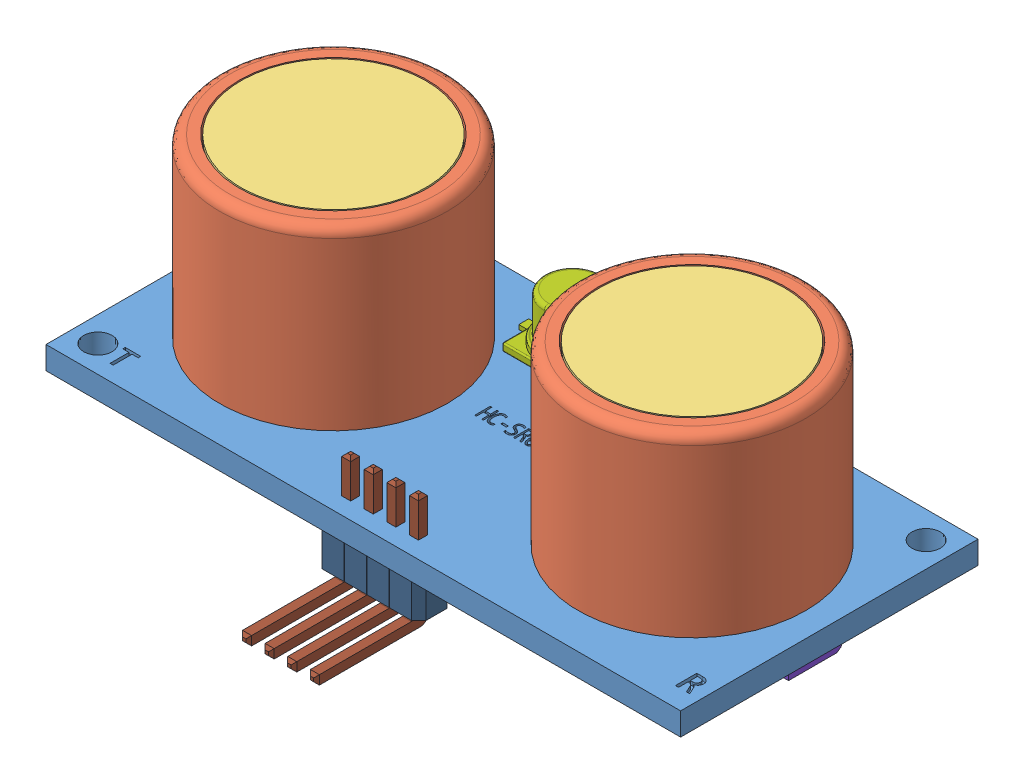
SolidWorks assembly Ultraconico.SLDASM, configuration Predeterminado (file format 6000). Lengths in mm.
Overall size (44.6 17.74 26.89).
52 component instances, 11 part files, 127 mates.
Components (placement in the parent):
- PCB-1: PCB.SLDPRT [Predeterminado] at (-26.5389 0.8067 34.15) size (44.6 1.6 20.9)
- E&T-1: E&T.SLDPRT [Predeterminado] at (-16.8389 14.8067 44.55) x (1 0 0) z (0 -1 0) size (16 16 12.4)
- malla-1: malla.SLDPRT [Predeterminado] at (-16.8389 14.5067 44.55) size (13 0.3 13)
- E&T-2: E&T.SLDPRT [Predeterminado] at (8.3611 14.8067 44.55) x (1 0 0) z (0 -1 0) size (16 16 12.4)
- malla-2: malla.SLDPRT [Predeterminado] at (8.3611 14.5067 44.55) x (0.999998 0 -0.002228) z (0.002228 0 0.999998) size (13 0.3 13)
- 0402c_2320560-1: 0402c_2320560.sldprt [Default] at (-0.5139 0.8067 39.9) x (1 0 0) z (0 -1 0) size (1.15 0.6 0.55)
- 0404_r_1620019-1: 0404_r_1620019.sldprt [Default] at (13.5911 0.8067 50.275) x (1 0 0) z (0 -1 0) size (1.08 1.55 0.45)
- User Library-SC70-5-1-1: User Library-SC70-5-1.SLDPRT [Default] at (-19.3317 0.8567 36.1092) x (0 0 -1) z (0 -1 0) size (2 2.1 0.95)
- User Library-ABLS2-1: User Library-ABLS2.SLDPRT [Default] at (-4.1889 2.4067 37.175) x (0 0 1) z (0 1 0) size (4.85 13.3 4)
- User Library-SOIC14-150-1-1: User Library-SOIC14-150-1.SLDPRT [Default] at (13.4916 1.1567 44.6252) x (1 0 0) z (0 -1 0) size (8.53 5.8 1.75)
- User Library-SOIC14-150-1-2: User Library-SOIC14-150-1.SLDPRT [Default] at (-6.0393 1.1567 44.599) x (1 0 0) z (0 -1 0) size (8.53 5.8 1.75)
- User Library-SOIC14-150-1-3: User Library-SOIC14-150-1.SLDPRT [Default] at (-22.9926 1.1567 44.18) x (0 0 -1) z (0 -1 0) size (8.53 5.8 1.75)
- 0402c_2320560-2: 0402c_2320560.sldprt [Default] at (-0.5139 0.8067 37.4) x (1 0 0) z (0 -1 0) size (1.15 0.6 0.55)
- User Library-SC70-5-1-2: User Library-SC70-5-1.SLDPRT [Default] at (5.8054 0.8067 36.1048) x (0 0 -1) z (0 -1 0) size (2 2.1 0.95)
- 0402c_2320560-3: 0402c_2320560.sldprt [Default] at (0.4861 0.8067 41.8) x (1 0 0) z (0 -1 0) size (1.15 0.6 0.55)
- 0404_r_1620019-2: 0404_r_1620019.sldprt [Default] at (15.5711 0.8067 50.275) x (1 0 0) z (0 -1 0) size (1.08 1.55 0.45)
- 0402c_2320560-4: 0402c_2320560.sldprt [Default] at (0.4861 0.8067 45.3) x (1 0 0) z (0 -1 0) size (1.15 0.6 0.55)
- 0402c_2320560-5: 0402c_2320560.sldprt [Default] at (0.4861 0.8067 48.8) x (1 0 0) z (0 -1 0) size (1.15 0.6 0.55)
- 0404_r_1620019-3: 0404_r_1620019.sldprt [Default] at (9.6311 0.8067 50.275) x (1 0 0) z (0 -1 0) size (1.08 1.55 0.45)
- 0404_r_1620019-4: 0404_r_1620019.sldprt [Default] at (5.0711 0.8067 44.725) x (1 0 0) z (0 -1 0) size (1.08 1.55 0.45)
- 0404_r_1620019-5: 0404_r_1620019.sldprt [Default] at (5.0711 0.8067 41.175) x (1 0 0) z (0 -1 0) size (1.08 1.55 0.45)
- 0404_r_1620019-6: 0404_r_1620019.sldprt [Default] at (7.6511 0.8067 50.275) x (1 0 0) z (0 -1 0) size (1.08 1.55 0.45)
- 0404_r_1620019-7: 0404_r_1620019.sldprt [Default] at (8.6111 0.8067 39.925) x (1 0 0) z (0 -1 0) size (1.08 1.55 0.45)
- 0404_r_1620019-8: 0404_r_1620019.sldprt [Default] at (11.5911 0.8067 39.925) x (1 0 0) z (0 -1 0) size (1.08 1.55 0.45)
- 0404_r_1620019-9: 0404_r_1620019.sldprt [Default] at (14.5711 0.8067 39.925) x (1 0 0) z (0 -1 0) size (1.08 1.55 0.45)
- 0404_r_1620019-10: 0404_r_1620019.sldprt [Default] at (5.6711 0.8067 50.275) x (1 0 0) z (0 -1 0) size (1.08 1.55 0.45)
- 0404_r_1620019-11: 0404_r_1620019.sldprt [Default] at (5.0711 0.8067 48.275) x (1 0 0) z (0 -1 0) size (1.08 1.55 0.45)
- 0404_r_1620019-12: 0404_r_1620019.sldprt [Default] at (11.6111 0.8067 50.275) x (1 0 0) z (0 -1 0) size (1.08 1.55 0.45)
- 0404_r_1620019-13: 0404_r_1620019.sldprt [Default] at (-8.4089 0.8067 38.425) x (1 0 0) z (0 -1 0) size (1.08 1.55 0.45)
- 0404_r_1620019-14: 0404_r_1620019.sldprt [Default] at (-15.2639 0.8067 37.64) x (0 0 1) z (0 -1 0) size (1.08 1.55 0.45)
- 0404_r_1620019-15: 0404_r_1620019.sldprt [Default] at (-4.4289 0.8067 38.425) x (1 0 0) z (0 -1 0) size (1.08 1.55 0.45)
- 0404_r_1620019-16: 0404_r_1620019.sldprt [Default] at (-13.4075 0.8067 44.275) x (1 0 0) z (0 -1 0) size (1.08 1.55 0.45)
- 0404_r_1620019-17: 0404_r_1620019.sldprt [Default] at (-10.0589 0.8067 49.275) x (1 0 0) z (0 -1 0) size (1.08 1.55 0.45)
- 0404_r_1620019-18: 0404_r_1620019.sldprt [Default] at (-6.5789 0.8067 49.275) x (1 0 0) z (0 -1 0) size (1.08 1.55 0.45)
- 0404_r_1620019-19: 0404_r_1620019.sldprt [Default] at (-23.0489 0.8067 50.992) x (1 0 0) z (0 -1 0) size (1.08 1.55 0.45)
- 0402r_1430758-1: 0402r_1430758.sldprt [Default] at (-17.0807 0.8067 41.925) x (1 0 0) z (0 -1 0) size (1.15 0.55 0.4)
- 0402r_1430758-2: 0402r_1430758.sldprt [Default] at (-17.0807 0.8067 44.375) x (1 0 0) z (0 -1 0) size (1.15 0.55 0.4)
- 0402r_1430758-3: 0402r_1430758.sldprt [Default] at (-17.0807 0.8067 46.825) x (1 0 0) z (0 -1 0) size (1.15 0.55 0.4)
- 0404_r_1620019-20: 0404_r_1620019.sldprt [Default] at (-24.5489 0.8067 38.425) x (1 0 0) z (0 -1 0) size (1.08 1.55 0.45)
- 0404_r_1620019-21: 0404_r_1620019.sldprt [Default] at (-21.5689 0.8067 38.425) x (1 0 0) z (0 -1 0) size (1.08 1.55 0.45)
- HeaderMale-1: HeaderMale.SLDASM [Predeterminado] at (-6.4519 -3.0933 53.6539) x (1 0 0) z (0 1 0) size (2.54 8.73 7.94)
  - pinB-1: pinB.SLDPRT [Predeterminado] at (-1.4403 1.348 1.3) size (2.54 2.5 2.6)
  - pinA-1: pinA.SLDPRT [Predeterminado] at (-0.4878 -7.384 0.1595) size (0.64 7.8 7.94)
- HeaderMale-2: HeaderMale.SLDASM [Predeterminado] at (-1.6864 -3.0933 53.6539) x (1 0 0) z (0 1 0) size (2.54 8.73 7.94)
  - pinB-1: pinB.SLDPRT [Predeterminado] at (-1.4403 1.348 1.3) size (2.54 2.5 2.6)
  - pinA-1: pinA.SLDPRT [Predeterminado] at (-0.4878 -7.384 0.1595) size (0.64 7.8 7.94)
- HeaderMale-3: HeaderMale.SLDASM [Predeterminado] at (-3.2749 -3.0933 53.6539) x (1 0 0) z (0 1 0) size (2.54 8.73 7.94)
  - pinB-1: pinB.SLDPRT [Predeterminado] at (-1.4403 1.348 1.3) size (2.54 2.5 2.6)
  - pinA-1: pinA.SLDPRT [Predeterminado] at (-0.4878 -7.384 0.1595) size (0.64 7.8 7.94)
- HeaderMale-4: HeaderMale.SLDASM [Predeterminado] at (-4.8634 -3.0933 53.6539) x (1 0 0) z (0 1 0) size (2.54 8.73 7.94)
  - pinB-1: pinB.SLDPRT [Predeterminado] at (-1.4403 1.348 1.3) size (2.54 2.5 2.6)
  - pinA-1: pinA.SLDPRT [Predeterminado] at (-0.4878 -7.384 0.1595) size (0.64 7.8 7.94)
Mates (geometry in assembly coordinates):
- Coincidente1: coincident anti-aligned: plane of PCB-1 through (-26.5389 2.4067 34.15) normal (0 1 0); plane of E&T-1 through (-16.8389 2.4067 44.55) normal (0 -1 0)
- Concéntrica1: concentric anti-aligned: cylinder of E&T-1 through (-16.8389 2.4067 44.55) axis (0 1 0) radius 6.6; cylinder of malla-1 through (-16.8389 14.8067 44.55) axis (0 -1 0) radius 6.5
- Coincidente2: coincident anti-aligned: circle of E&T-1; plane of malla-1 through (-16.8389 14.8067 44.55) normal (0 1 0)
- Coincidente3: coincident anti-aligned: plane of PCB-1 through (-26.5389 2.4067 34.15) normal (0 1 0); plane of E&T-2 through (8.3611 2.4067 44.55) normal (0 -1 0)
- Concéntrica3: concentric anti-aligned: cylinder of E&T-2 through (8.3611 2.4067 44.55) axis (0 1 0) radius 6.6; cylinder of malla-2 through (8.3611 14.8067 44.55) axis (0 -1 0) radius 6.5
- Coincidente4: coincident anti-aligned: circle of E&T-2; plane of malla-2 through (8.3611 14.8067 44.55) normal (0 1 0)
- Distancia2: distance = 1.7 mm: cylinder of E&T-1 through (-16.8389 2.4067 44.55) axis (0 1 0) radius 8; line of PCB-1 through (-26.5389 2.4067 34.15) axis (0 0 1)
- Distancia3: distance = 1.7 mm: cylinder of E&T-2 through (8.3611 2.4067 44.55) axis (0 1 0) radius 8; line of PCB-1 through (18.0611 2.4067 55.05) axis (0 0 -1)
- Distancia4: distance = 2.5 mm: cylinder of E&T-1 through (-16.8389 2.4067 44.55) axis (0 1 0) radius 8; line of PCB-1 through (-26.5389 2.4067 55.05) axis (1 0 0)
- Distancia5: distance = 2.5 mm: cylinder of E&T-2 through (8.3611 2.4067 44.55) axis (0 1 0) radius 8; line of PCB-1 through (-26.5389 2.4067 55.05) axis (1 0 0)
- Coincidente12: coincident anti-aligned: plane of PCB-1 through (-26.5389 0.8067 34.15) normal (0 -1 0); plane of User Library-SC70-5-1-1 through (-18.7067 0.8067 35.1092) normal (0 1 0)
- Coincidente13: coincident anti-aligned: plane of PCB-1 through (-26.5389 0.8067 34.15) normal (0 -1 0); plane of 0404_r_1620019-1 through (13.0511 0.8067 49.5) normal (0 1 0)
- Coincidente14: coincident anti-aligned: plane of PCB-1 through (-26.5389 0.8067 34.15) normal (0 -1 0); plane of 0402c_2320560-1 through (-0.5139 0.8067 40.75) normal (0 1 0)
- Coincidente15: coincident anti-aligned: plane of PCB-1 through (-26.5389 2.4067 34.15) normal (0 1 0); plane of User Library-ABLS2-1 through (2.4611 2.4067 37.525) normal (0 -1 0)
- Coincidente16: coincident anti-aligned: plane of PCB-1 through (-26.5389 0.8067 34.15) normal (0 -1 0); plane of User Library-SOIC14-150-1-1 through (18.3916 0.8067 42.7252) normal (0 1 0)
- Distancia6: distance = 0.6 mm aligned: plane of User Library-ABLS2-1 through (-9.9389 2.5567 34.75) normal (0 0 -1); plane of PCB-1 through (-26.5389 2.4067 34.15) normal (0 0 -1)
- Distancia7: distance = 16.5 mm aligned: plane of PCB-1 through (18.0611 2.4067 34.15) normal (1 0 0); plane of User Library-ABLS2-1 through (1.5611 2.5567 39.6) normal (1 0 0)
- Coincidente19: coincident anti-aligned: plane of PCB-1 through (-26.5389 0.8067 34.15) normal (0 -1 0); plane of User Library-SOIC14-150-1-3 through (-24.8926 0.8067 39.28) normal (0 1 0)
- Coincidente20: coincident anti-aligned: plane of PCB-1 through (-26.5389 0.8067 34.15) normal (0 -1 0); plane of User Library-SOIC14-150-1-2 through (-1.1393 0.8067 42.699) normal (0 1 0)
- Distancia8: distance = 1.0453 mm: line of User Library-SOIC14-150-1-1 through (17.0158 0.8067 46.4621) axis (0 0 -1); plane of PCB-1 through (18.0611 2.4067 34.15) normal (1 0 0)
- Distancia9: distance = 8.5879 mm: line of User Library-SOIC14-150-1-1 through (8.6546 0.8067 46.4621) axis (1 0 0); plane of PCB-1 through (18.0611 2.4067 55.05) normal (0 0 1)
- Distancia10: distance = 11 mm: plane of User Library-SOIC14-150-1-2 through (-2.4093 0.2067 41.699) normal (0.984808 0.173648 0); line of User Library-SOIC14-150-1-1 through (8.6546 0.8067 42.7883) axis (0 0 1)
- Distancia11: distance = 8.5669 mm: plane of User Library-SOIC14-150-1-2 through (-1.1393 0.8067 46.4359) normal (0 0.104528 0.994522); line of PCB-1 through (-26.5389 0.8067 55.05) axis (1 0 0)
- Distancia12: distance = 1.7 mm: plane of User Library-SOIC14-150-1-3 through (-24.8296 0.8067 39.28) normal (-0.994522 0.104528 0); line of PCB-1 through (-26.5389 0.8067 34.15) axis (0 0 1)
- Distancia13: distance = 6 mm: plane of User Library-SOIC14-150-1-3 through (-24.8926 0.8067 49.017) normal (0 0.104528 0.994522); line of PCB-1 through (-26.5389 0.8067 55.05) axis (1 0 0)
- Coincidente27: coincident anti-aligned: plane of PCB-1 through (-26.5389 0.8067 34.15) normal (0 -1 0); plane of User Library-SC70-5-1-2 through (6.6554 0.8067 36.6423) normal (0 1 0)
- Coincidente28: coincident anti-aligned: plane of PCB-1 through (-26.5389 0.8067 34.15) normal (0 -1 0); plane of 0402c_2320560-2 through (-0.5139 0.8067 38.25) normal (0 1 0)
- Coincidente29: coincident anti-aligned: plane of PCB-1 through (-26.5389 0.8067 34.15) normal (0 -1 0); plane of 0402c_2320560-3 through (0.4861 0.8067 42.65) normal (0 1 0)
- Coincidente30: coincident anti-aligned: plane of PCB-1 through (-26.5389 0.8067 34.15) normal (0 -1 0); plane of 0402c_2320560-4 through (0.4861 0.8067 46.15) normal (0 1 0)
- Coincidente31: coincident anti-aligned: plane of PCB-1 through (-26.5389 0.8067 34.15) normal (0 -1 0); plane of 0402c_2320560-5 through (0.4861 0.8067 49.65) normal (0 1 0)
- Coincidente32: coincident anti-aligned: plane of PCB-1 through (-26.5389 0.8067 34.15) normal (0 -1 0); plane of 0404_r_1620019-2 through (15.0311 0.8067 49.5) normal (0 1 0)
- Distancia14: distance = 11.6352 mm: line of PCB-1 through (18.0611 0.8067 55.05) axis (0 0 -1); plane of User Library-SC70-5-1-2 through (6.4304 0.2467 37.1048) normal (0.996195 0.087156 0)
- Distancia15: distance = 1 mm: plane of User Library-SC70-5-1-2 through (5.1804 0.2467 35.1048) normal (0 0.087156 -0.996195); line of PCB-1 through (18.0611 0.8067 34.15) axis (-1 0 0)
- Distancia16: distance = 6.6017 mm: plane of User Library-SC70-5-1-1 through (-19.9567 0.2967 37.1092) normal (-0.996195 0.087156 0); line of PCB-1 through (-26.5389 0.8067 34.15) axis (0 0 1)
- Distancia17: distance = 1 mm: plane of User Library-SC70-5-1-1 through (-19.9567 0.2967 35.1092) normal (0 0.087156 -0.996195); line of PCB-1 through (18.0611 0.8067 34.15) axis (-1 0 0)
- Coincidente37: coincident anti-aligned: plane of PCB-1 through (-26.5389 0.8067 34.15) normal (0 -1 0); plane of 0404_r_1620019-9 through (14.0311 0.8067 39.15) normal (0 1 0)
- Coincidente38: coincident anti-aligned: plane of PCB-1 through (-26.5389 0.8067 34.15) normal (0 -1 0); plane of 0404_r_1620019-8 through (11.0511 0.8067 39.15) normal (0 1 0)
- Coincidente39: coincident anti-aligned: plane of PCB-1 through (-26.5389 0.8067 34.15) normal (0 -1 0); plane of 0404_r_1620019-7 through (8.0711 0.8067 39.15) normal (0 1 0)
- Coincidente40: coincident anti-aligned: plane of PCB-1 through (-26.5389 0.8067 34.15) normal (0 -1 0); plane of 0404_r_1620019-10 through (5.1311 0.8067 49.5) normal (0 1 0)
- Coincidente41: coincident anti-aligned: plane of PCB-1 through (-26.5389 0.8067 34.15) normal (0 -1 0); plane of 0404_r_1620019-6 through (7.1111 0.8067 49.5) normal (0 1 0)
- Coincidente42: coincident anti-aligned: plane of PCB-1 through (-26.5389 0.8067 34.15) normal (0 -1 0); plane of 0404_r_1620019-5 through (4.5311 0.8067 40.4) normal (0 1 0)
- Coincidente43: coincident anti-aligned: plane of PCB-1 through (-26.5389 0.8067 34.15) normal (0 -1 0); plane of 0404_r_1620019-4 through (4.5311 0.8067 43.95) normal (0 1 0)
- Coincidente44: coincident anti-aligned: plane of PCB-1 through (-26.5389 0.8067 34.15) normal (0 -1 0); plane of 0404_r_1620019-11 through (4.5311 0.8067 47.5) normal (0 1 0)
- Coincidente45: coincident anti-aligned: plane of PCB-1 through (-26.5389 0.8067 34.15) normal (0 -1 0); plane of 0404_r_1620019-3 through (9.0911 0.8067 49.5) normal (0 1 0)
- Coincidente46: coincident anti-aligned: plane of PCB-1 through (-26.5389 0.8067 34.15) normal (0 -1 0); plane of 0404_r_1620019-12 through (11.0711 0.8067 49.5) normal (0 1 0)
- Coincidente47: coincident anti-aligned: plane of PCB-1 through (-26.5389 0.8067 34.15) normal (0 -1 0); plane of 0404_r_1620019-15 through (-4.9689 0.8067 37.65) normal (0 1 0)
- Coincidente48: coincident anti-aligned: plane of PCB-1 through (-26.5389 0.8067 34.15) normal (0 -1 0); plane of 0404_r_1620019-13 through (-8.9489 0.8067 37.65) normal (0 1 0)
- Coincidente49: coincident anti-aligned: plane of PCB-1 through (-26.5389 0.8067 34.15) normal (0 -1 0); plane of 0404_r_1620019-14 through (-14.4889 0.8067 37.1) normal (0 1 0)
- Coincidente50: coincident anti-aligned: plane of PCB-1 through (-26.5389 0.8067 34.15) normal (0 -1 0); plane of 0404_r_1620019-16 through (-13.9475 0.8067 43.5) normal (0 1 0)
- Coincidente51: coincident anti-aligned: plane of PCB-1 through (-26.5389 0.8067 34.15) normal (0 -1 0); plane of 0404_r_1620019-17 through (-10.5989 0.8067 48.5) normal (0 1 0)
- Coincidente52: coincident anti-aligned: plane of PCB-1 through (-26.5389 0.8067 34.15) normal (0 -1 0); plane of 0404_r_1620019-18 through (-7.1189 0.8067 48.5) normal (0 1 0)
- Coincidente53: coincident anti-aligned: plane of PCB-1 through (-26.5389 0.8067 34.15) normal (0 -1 0); plane of 0404_r_1620019-19 through (-23.5889 0.8067 50.217) normal (0 1 0)
- Distancia18: distance = 2 mm: plane of 0404_r_1620019-2 through (16.0611 0.8067 49.9) normal (1 0 0); line of PCB-1 through (18.0611 0.8067 55.05) axis (0 0 -1)
- Distancia19: distance = 1 mm: plane of 0404_r_1620019-1 through (14.0811 0.8067 49.9) normal (1 0 0); line of 0404_r_1620019-2 through (15.0811 0.8067 49.9) axis (0 0 1)
- Distancia20: distance = 1 mm: plane of 0404_r_1620019-12 through (12.1011 0.8067 49.9) normal (1 0 0); line of 0404_r_1620019-1 through (13.1011 0.8067 49.9) axis (0 0 1)
- Distancia21: distance = 1 mm: plane of 0404_r_1620019-3 through (10.1211 0.8067 49.9) normal (1 0 0); line of 0404_r_1620019-12 through (11.1211 0.8067 49.9) axis (0 0 1)
- Distancia22: distance = 12.5 mm: plane of 0404_r_1620019-11 through (5.5611 0.8067 47.9) normal (1 0 0); line of PCB-1 through (18.0611 0.8067 55.05) axis (0 0 -1)
- Distancia23: distance = 12.5 mm: plane of 0404_r_1620019-4 through (5.5611 0.8067 44.35) normal (1 0 0); line of PCB-1 through (18.0611 0.8067 55.05) axis (0 0 -1)
- Distancia24: distance = 12.5 mm: plane of 0404_r_1620019-5 through (5.5611 0.8067 40.8) normal (1 0 0); line of PCB-1 through (18.0611 0.8067 55.05) axis (0 0 -1)
- Distancia25: distance = 1 mm: plane of 0404_r_1620019-6 through (8.1411 0.8067 49.9) normal (1 0 0); line of 0404_r_1620019-3 through (9.1411 0.8067 49.9) axis (0 0 1)
- Distancia26: distance = 1 mm: plane of 0404_r_1620019-10 through (6.1611 0.8067 49.9) normal (1 0 0); line of 0404_r_1620019-6 through (7.1611 0.8067 49.9) axis (0 0 1)
- Distancia27: distance = 3 mm: plane of 0404_r_1620019-9 through (15.0611 0.8067 39.55) normal (1 0 0); line of PCB-1 through (18.0611 0.8067 55.05) axis (0 0 -1)
- Distancia28: distance = 2 mm: plane of 0404_r_1620019-8 through (12.0811 0.8067 39.55) normal (1 0 0); line of 0404_r_1620019-9 through (14.0811 0.8067 39.55) axis (0 0 1)
- Distancia29: distance = 2 mm: plane of 0404_r_1620019-7 through (9.1011 0.8067 39.55) normal (1 0 0); line of 0404_r_1620019-8 through (11.1011 0.8067 39.55) axis (0 0 1)
- Distancia30: distance = 17 mm: line of 0402c_2320560-3 through (1.0611 0.8067 41.525) axis (0 0 1); line of PCB-1 through (18.0611 0.8067 55.05) axis (0 0 -1)
- Distancia31: distance = 17 mm: line of 0402c_2320560-4 through (1.0611 0.8067 45.025) axis (0 0 1); plane of PCB-1 through (18.0611 2.4067 34.15) normal (1 0 0)
- Distancia32: distance = 17 mm: plane of 0402c_2320560-5 through (1.0611 0.2567 48.525) normal (1 0 0); line of PCB-1 through (18.0611 0.8067 55.05) axis (0 0 -1)
- Distancia33: distance = 18 mm: plane of 0402c_2320560-1 through (0.0611 0.2567 39.625) normal (1 0 0); line of PCB-1 through (18.0611 0.8067 55.05) axis (0 0 -1)
- Distancia34: distance = 18 mm: plane of 0402c_2320560-2 through (0.0611 0.2567 37.125) normal (1 0 0); line of PCB-1 through (18.0611 0.8067 55.05) axis (0 0 -1)
- Distancia35: distance = 4 mm: plane of 0404_r_1620019-2 through (16.1111 0.3567 51.05) normal (0 0 1); line of PCB-1 through (-26.5389 0.8067 55.05) axis (1 0 0)
- Distancia36: distance = 4 mm: plane of 0404_r_1620019-1 through (14.1311 0.3567 51.05) normal (0 0 1); line of PCB-1 through (-26.5389 0.8067 55.05) axis (1 0 0)
- Distancia37: distance = 4 mm: plane of 0404_r_1620019-12 through (12.1511 0.3567 51.05) normal (0 0 1); line of PCB-1 through (-26.5389 0.8067 55.05) axis (1 0 0)
- Distancia38: distance = 4 mm: plane of 0404_r_1620019-3 through (10.1711 0.3567 51.05) normal (0 0 1); line of PCB-1 through (-26.5389 0.8067 55.05) axis (1 0 0)
- Distancia39: distance = 4 mm: plane of 0404_r_1620019-6 through (8.1911 0.3567 51.05) normal (0 0 1); line of PCB-1 through (-26.5389 0.8067 55.05) axis (1 0 0)
- Distancia40: distance = 4 mm: plane of 0404_r_1620019-10 through (6.2111 0.3567 51.05) normal (0 0 1); line of PCB-1 through (-26.5389 0.8067 55.05) axis (1 0 0)
- Distancia41: distance = 6 mm: plane of 0404_r_1620019-11 through (5.6111 0.3567 49.05) normal (0 0 1); line of PCB-1 through (-26.5389 0.8067 55.05) axis (1 0 0)
- Distancia42: distance = 2 mm: plane of 0404_r_1620019-11 through (4.5311 0.3567 47.5) normal (0 0 -1); line of 0404_r_1620019-4 through (5.6111 0.8067 45.5) axis (-1 0 0)
- Distancia43: distance = 2 mm: plane of 0404_r_1620019-4 through (4.5311 0.3567 43.95) normal (0 0 -1); line of 0404_r_1620019-5 through (5.6111 0.8067 41.95) axis (-1 0 0)
- Distancia44: distance = 5 mm: plane of 0404_r_1620019-7 through (8.0711 0.3567 39.15) normal (0 0 -1); line of PCB-1 through (18.0611 0.8067 34.15) axis (-1 0 0)
- Distancia45: distance = 5 mm: plane of 0404_r_1620019-8 through (11.0511 0.3567 39.15) normal (0 0 -1); line of PCB-1 through (18.0611 0.8067 34.15) axis (-1 0 0)
- Distancia46: distance = 5 mm: plane of 0404_r_1620019-9 through (14.0311 0.3567 39.15) normal (0 0 -1); line of PCB-1 through (18.0611 0.8067 34.15) axis (-1 0 0)
- Distancia48: distance = 6 mm: plane of 0402c_2320560-5 through (0.7611 10.2567 49.05) normal (0 0 1); line of PCB-1 through (-26.5389 0.8067 55.05) axis (1 0 0)
- Distancia49: distance = 3 mm: plane of 0402c_2320560-4 through (0.7611 10.2567 45.55) normal (0 0 1); line of 0402c_2320560-5 through (0.7611 0.8067 48.55) axis (-1 0 0)
- Distancia50: distance = 3 mm: plane of 0402c_2320560-4 through (0.2111 10.2567 45.05) normal (0 0 -1); line of 0402c_2320560-3 through (0.2111 0.8067 42.05) axis (1 0 0)
- Distancia51: distance = 3 mm: plane of 0402c_2320560-2 through (-0.7889 10.2567 37.15) normal (0 0 -1); line of PCB-1 through (18.0611 0.8067 34.15) axis (-1 0 0)
- Distancia52: distance = 2 mm: plane of 0402c_2320560-1 through (-0.7889 10.2567 39.65) normal (0 0 -1); line of 0402c_2320560-2 through (-0.7889 0.8067 37.65) axis (1 0 0)
- Coincidente89: coincident anti-aligned: plane of PCB-1 through (-26.5389 0.8067 34.15) normal (0 -1 0); plane of 0402r_1430758-1 through (-17.0807 0.8067 42.75) normal (0 1 0)
- Coincidente90: coincident anti-aligned: plane of PCB-1 through (-26.5389 0.8067 34.15) normal (0 -1 0); plane of 0402r_1430758-2 through (-17.0807 0.8067 45.2) normal (0 1 0)
- Coincidente91: coincident anti-aligned: plane of PCB-1 through (-26.5389 0.8067 34.15) normal (0 -1 0); plane of 0402r_1430758-3 through (-17.0807 0.8067 47.65) normal (0 1 0)
- Coincidente92: coincident anti-aligned: plane of PCB-1 through (-26.5389 0.8067 34.15) normal (0 -1 0); plane of 0404_r_1620019-21 through (-22.1089 0.8067 37.65) normal (0 1 0)
- Coincidente93: coincident anti-aligned: plane of PCB-1 through (-26.5389 0.8067 34.15) normal (0 -1 0); plane of 0404_r_1620019-20 through (-25.0889 0.8067 37.65) normal (0 1 0)
- Distancia53: distance = 3.5 mm: plane of 0404_r_1620019-15 through (-4.9689 0.3567 37.65) normal (0 0 -1); line of PCB-1 through (18.0611 0.8067 34.15) axis (-1 0 0)
- Distancia54: distance = 3.5 mm: plane of 0404_r_1620019-13 through (-8.9489 0.3567 37.65) normal (0 0 -1); line of PCB-1 through (18.0611 0.8067 34.15) axis (-1 0 0)
- Distancia55: distance = 22 mm: plane of 0404_r_1620019-15 through (-3.9389 0.8067 38.05) normal (1 0 0); line of PCB-1 through (18.0611 0.8067 55.05) axis (0 0 -1)
- Distancia56: distance = 3 mm: plane of 0404_r_1620019-13 through (-7.9189 0.8067 38.05) normal (1 0 0); line of 0404_r_1620019-15 through (-4.9189 0.8067 38.05) axis (0 0 1)
- Distancia57: distance = 3 mm: plane of 0404_r_1620019-14 through (-15.6389 0.8067 37.15) normal (0 0 -1); line of PCB-1 through (18.0611 0.8067 34.15) axis (-1 0 0)
- Distancia58: distance = 10.5 mm: plane of 0404_r_1620019-14 through (-16.0389 0.3567 38.18) normal (-1 0 0); line of PCB-1 through (-26.5389 0.8067 34.15) axis (0 0 1)
- Distancia59: distance = 3.5 mm: plane of 0404_r_1620019-21 through (-22.1089 0.3567 37.65) normal (0 0 -1); line of PCB-1 through (18.0611 0.8067 34.15) axis (-1 0 0)
- Distancia60: distance = 3.5 mm: plane of 0404_r_1620019-20 through (-25.0889 0.3567 37.65) normal (0 0 -1); line of PCB-1 through (18.0611 0.8067 34.15) axis (-1 0 0)
- Distancia61: distance = 1.5 mm: plane of 0404_r_1620019-20 through (-25.0389 0.8067 38.8) normal (-1 0 0); line of PCB-1 through (-26.5389 0.8067 34.15) axis (0 0 1)
- Distancia62: distance = 2 mm: plane of 0404_r_1620019-21 through (-22.0589 0.8067 38.8) normal (-1 0 0); line of 0404_r_1620019-20 through (-24.0589 0.8067 38.8) axis (0 0 -1)
- Distancia63: distance = 2.0413 mm: plane of 0404_r_1620019-16 through (-12.9175 0.8067 43.9) normal (1 0 0); line of User Library-SOIC14-150-1-2 through (-10.8762 0.8067 42.762) axis (0 0 1)
- Distancia64: distance = 10 mm: line of PCB-1 through (-26.5389 0.8067 55.05) axis (1 0 0); plane of 0404_r_1620019-16 through (-12.8675 0.3567 45.05) normal (0 0 1)
- Distancia65: distance = 6 mm: plane of 0402c_2320560-5 through (-0.0889 0.2567 49.075) normal (-1 0 0); line of 0404_r_1620019-18 through (-6.0889 0.8067 49.65) axis (0 0 -1)
- Distancia66: distance = 2.5 mm: plane of 0404_r_1620019-17 through (-9.5689 0.8067 48.9) normal (1 0 0); line of 0404_r_1620019-18 through (-7.0689 0.8067 48.9) axis (0 0 1)
- Distancia67: distance = 5 mm: plane of 0404_r_1620019-17 through (-9.5189 0.3567 50.05) normal (0 0 1); line of PCB-1 through (-26.5389 0.8067 55.05) axis (1 0 0)
- Distancia68: distance = 5 mm: plane of 0404_r_1620019-18 through (-6.0389 0.3567 50.05) normal (0 0 1); line of PCB-1 through (-26.5389 0.8067 55.05) axis (1 0 0)
- Distancia69: distance = 1.2 mm: plane of 0404_r_1620019-19 through (-23.5889 0.3567 50.217) normal (0 0 -1); line of User Library-SOIC14-150-1-3 through (-24.8296 0.8067 49.017) axis (1 0 0)
- Distancia70: distance = 3 mm: plane of 0404_r_1620019-19 through (-23.5389 0.8067 51.367) normal (-1 0 0); line of PCB-1 through (-26.5389 0.8067 34.15) axis (0 0 1)
- Distancia71: distance = 8 mm: plane of 0402r_1430758-3 through (-16.8057 0.8067 47.05) normal (0 0 1); line of PCB-1 through (-26.5389 0.8067 55.05) axis (1 0 0)
- Distancia72: distance = 2 mm: plane of 0402r_1430758-2 through (-16.8057 0.8067 44.6) normal (0 0 1); line of 0402r_1430758-3 through (-16.8057 0.8067 46.6) axis (-1 0 0)
- Distancia73: distance = 2 mm: plane of 0402r_1430758-2 through (-17.3557 0.8067 44.15) normal (0 0 -1); line of 0402r_1430758-1 through (-17.3557 0.8067 42.15) axis (1 0 0)
- Distancia74: distance = 3.5 mm: plane of 0402r_1430758-1 through (-17.6557 0.4067 42.175) normal (-1 0 0); line of User Library-SOIC14-150-1-3 through (-21.1557 0.8067 49.017) axis (0 0 -1)
- Distancia75: distance = 3.5 mm: line of User Library-SOIC14-150-1-3 through (-21.1557 0.8067 49.017) axis (0 0 -1); plane of 0402r_1430758-2 through (-17.6557 0.4067 44.625) normal (-1 0 0)
- Distancia76: distance = 3.5 mm: plane of 0402r_1430758-3 through (-17.6557 0.4067 47.075) normal (-1 0 0); line of User Library-SOIC14-150-1-3 through (-21.1557 0.8067 49.017) axis (0 0 -1)
- Coincidente106: coincident: plane of PCB-1 through (-2.1742 -7.5933 53.2378) normal (1 0 0); plane of HeaderMale-2/pinA-1 through (-2.1742 -2.9338 53.2378) normal (-1 0 0)
- Coincidente107: coincident: plane of PCB-1 through (-2.1742 -7.5933 53.2378) normal (0 0 1); plane of HeaderMale-2/pinA-1 through (-2.1742 -2.9338 53.2378) normal (0 0 -1)
- Coincidente108: coincident: plane of PCB-1 through (-3.7627 -7.5933 53.2378) normal (0 0 1); plane of HeaderMale-4/pinA-1 through (-5.3512 -2.9338 53.2378) normal (0 0 -1)
- Coincidente109: coincident: plane of PCB-1 through (-4.7152 -7.5933 53.2378) normal (0 0 1); plane of HeaderMale-3/pinA-1 through (-3.7627 -2.9338 53.2378) normal (0 0 -1)
- Coincidente110: coincident: plane of PCB-1 through (-6.3037 -7.5933 53.2378) normal (0 0 1); plane of HeaderMale-1/pinA-1 through (-6.9397 -2.9338 53.2378) normal (0 0 -1)
- Coincidente111: coincident: plane of PCB-1 through (-3.1267 -7.5933 53.2378) normal (-1 0 0); plane of HeaderMale-3/pinA-1 through (-3.1267 -2.9338 53.2378) normal (1 0 0)
- Coincidente112: coincident: plane of PCB-1 through (-4.7152 -7.5933 53.2378) normal (-1 0 0); plane of HeaderMale-4/pinA-1 through (-4.7152 -2.9338 53.2378) normal (1 0 0)
- Coincidente113: coincident: plane of PCB-1 through (-6.3037 -7.5933 53.2378) normal (-1 0 0); plane of HeaderMale-1/pinA-1 through (-6.3037 -2.9338 53.2378) normal (1 0 0)
- Coincidente114: coincident anti-aligned: plane of PCB-1 through (-26.5389 0.8067 34.15) normal (0 -1 0); plane of HeaderMale-2/pinB-1 through (-3.1267 0.8067 52.3058) normal (0 1 0)
- Coincidente115: coincident anti-aligned: plane of PCB-1 through (-26.5389 0.8067 34.15) normal (0 -1 0); plane of HeaderMale-3/pinB-1 through (-4.7152 0.8067 52.3058) normal (0 1 0)
- Coincidente116: coincident anti-aligned: plane of PCB-1 through (-26.5389 0.8067 34.15) normal (0 -1 0); plane of HeaderMale-4/pinB-1 through (-6.3037 0.8067 52.3058) normal (0 1 0)
- Coincidente117: coincident anti-aligned: plane of PCB-1 through (-26.5389 0.8067 34.15) normal (0 -1 0); plane of HeaderMale-1/pinB-1 through (-7.8922 0.8067 52.3058) normal (0 1 0)
